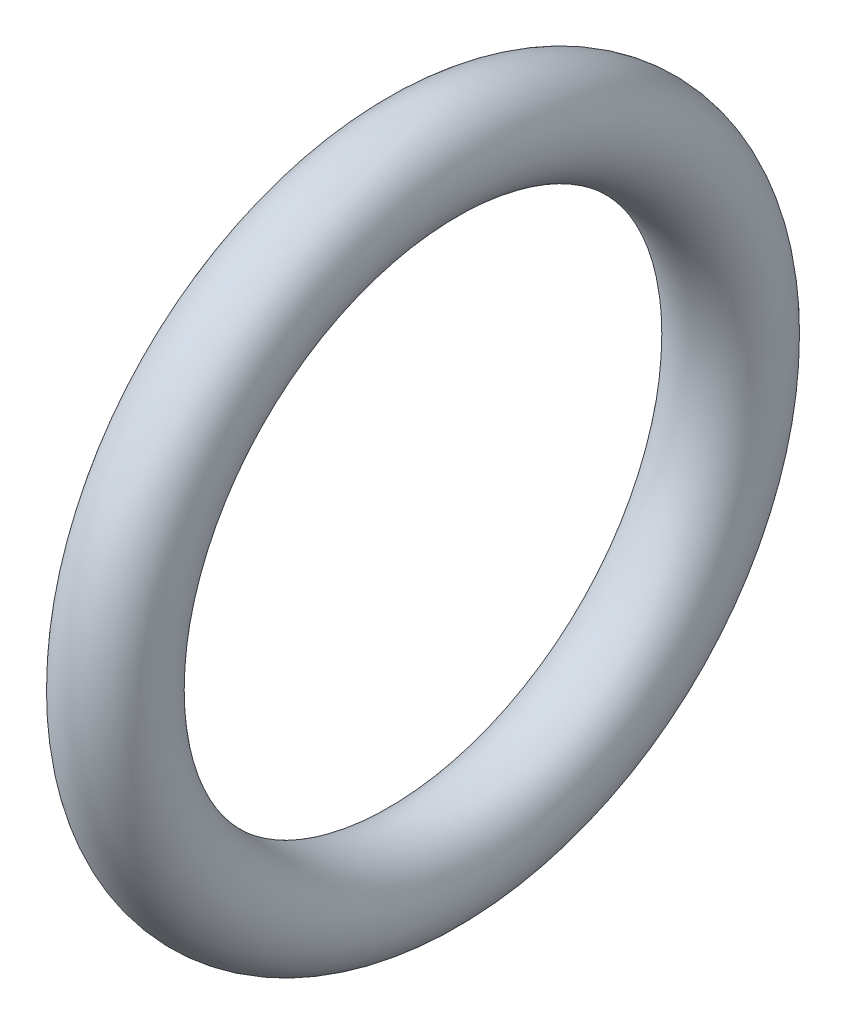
from build123d import *

# Parameters (mm, degrees)
ESQUISSE1_R = 0.95


with BuildPart() as part:
    # Esquisse1 → R_volution1 (revolve)
    with BuildSketch(Plane.XY, mode=Mode.PRIVATE) as r_volution1_sk:
        with Locations((0, 6)):
            Circle(ESQUISSE1_R)
    revolve(r_volution1_sk.sketch.rotate(Axis((0, 0, 0), (1, 0, 0)), 90), axis=Axis((0, 0, 0), (1, 0, 0)))


solid = part.part
